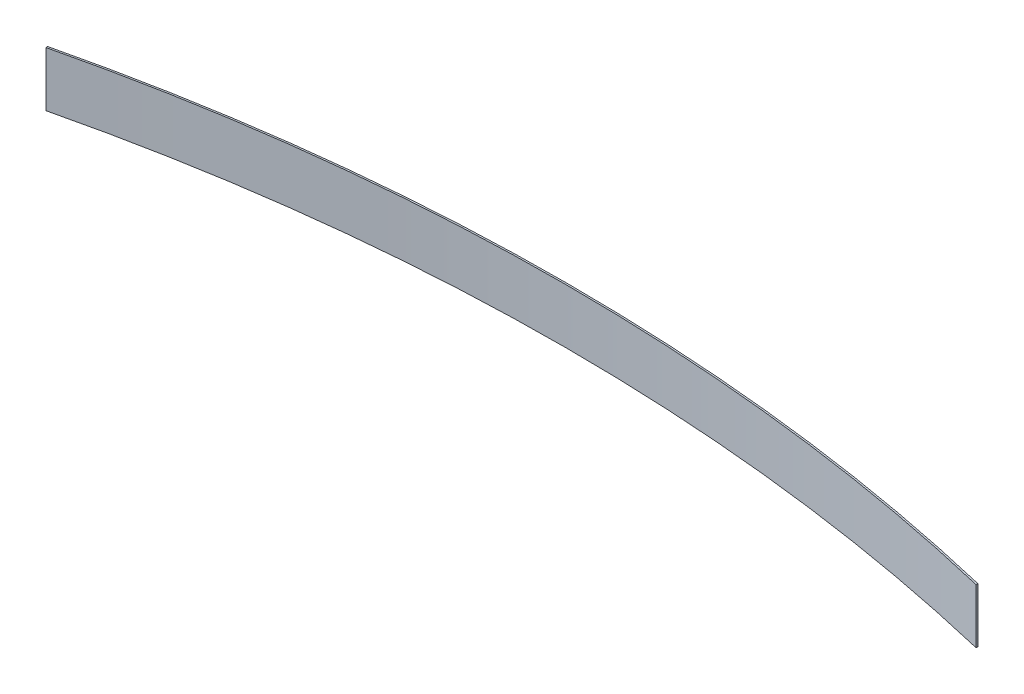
from build123d import *

# Parameters (mm, degrees)
SKETCH1_W      = 101.6
SKETCH1_H      = 3.175
REVOLVE1_ANGLE = 26.839347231


with BuildPart() as part:
    # Sketch1 → Revolve1 (revolve)
    with BuildSketch(Plane(origin=(1634.169530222, 0, 389.907115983), x_dir=(0, 1, 0), z_dir=(0.9726962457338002, 0, 0.23208191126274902))):
        with Locations((50.8, -402.439377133)):
            Rectangle(SKETCH1_W, SKETCH1_H)
    revolve(axis=Axis((863.6, 101.6, 3619.5), (0, 1, 0)), revolution_arc=REVOLVE1_ANGLE)


solid = part.part
